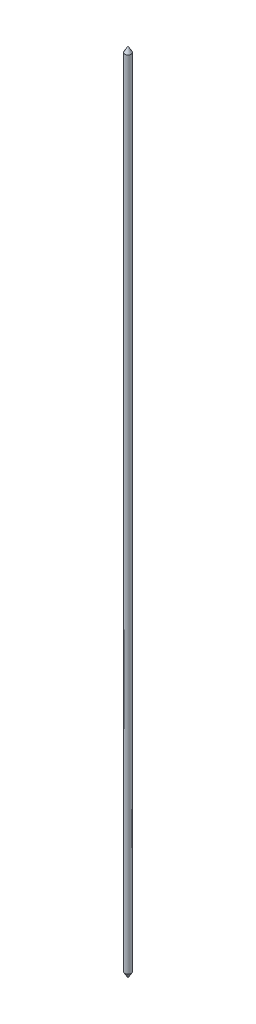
from build123d import *

# Parameters (mm, degrees)
CROQUIS1_R              = 1
SALIENTE_EXTRUIR1_DEPTH = 250


with BuildPart() as part:
    # Croquis1 → Saliente-Extruir1 (new body)
    with BuildSketch(Plane(origin=(0, 0, 0), x_dir=(1, 0, 0), z_dir=(0, 1, 0))):
        with Locations(Location((0, 0, 0), (0, 0, 270))):
            Circle(CROQUIS1_R)
    extrude(amount=SALIENTE_EXTRUIR1_DEPTH)

    # Saliente-Extruir2 cone 1 section (on through the dimple's axis) → Saliente-Extruir2 (revolve)
    with BuildSketch(Plane(origin=(0, 250, 0), x_dir=(0, 0, -1), z_dir=(1, 0, 0))):
        Polygon((0, 0), (1, 0), (0, 1.732050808), align=None)
    revolve(axis=Axis((0, 250, 0), (0, 1, 0)))

    # Saliente-Extruir3 cone 1 section (on through the dimple's axis) → Saliente-Extruir3 (revolve)
    with BuildSketch(Plane(origin=(0, 0, 0), x_dir=(0, 0, 1), z_dir=(1, 0, 0))):
        Polygon((0, 0), (1, 0), (0, 1.732050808), align=None)
    revolve(axis=Axis((0, 0, 0), (0, -1, 0)))


solid = part.part
